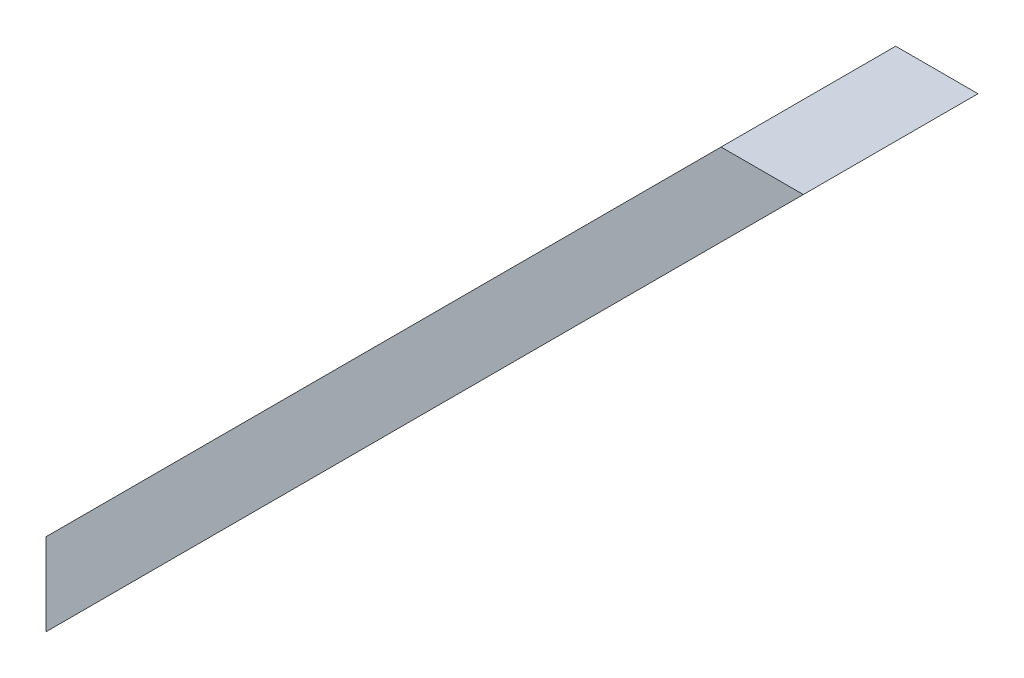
ISO-10303-21;
HEADER;
FILE_DESCRIPTION(('STEP AP214'),'2;1');
FILE_NAME('part.step','',(''),(''),'','','');
FILE_SCHEMA(('AUTOMOTIVE_DESIGN { 1 0 10303 214 1 1 1 1 }'));
ENDSEC;
DATA;
#1=APPLICATION_CONTEXT('core data for automotive mechanical design processes');
#2=APPLICATION_PROTOCOL_DEFINITION('international standard','automotive_design',2000,#1);
#3=PRODUCT_CONTEXT('',#1,'mechanical');
#4=PRODUCT('Part','Part','',(#3));
#5=PRODUCT_RELATED_PRODUCT_CATEGORY('part','',(#4));
#6=PRODUCT_DEFINITION_FORMATION('','',#4);
#7=PRODUCT_DEFINITION_CONTEXT('part definition',#1,'design');
#8=PRODUCT_DEFINITION('design','',#6,#7);
#9=PRODUCT_DEFINITION_SHAPE('','',#8);
#10=(LENGTH_UNIT() NAMED_UNIT(*) SI_UNIT(.MILLI.,.METRE.));
#11=(NAMED_UNIT(*) PLANE_ANGLE_UNIT() SI_UNIT($,.RADIAN.));
#12=(NAMED_UNIT(*) SI_UNIT($,.STERADIAN.) SOLID_ANGLE_UNIT());
#13=UNCERTAINTY_MEASURE_WITH_UNIT(LENGTH_MEASURE(1.E-05),#10,'distance_accuracy_value','');
#14=(GEOMETRIC_REPRESENTATION_CONTEXT(3) GLOBAL_UNCERTAINTY_ASSIGNED_CONTEXT((#13)) GLOBAL_UNIT_ASSIGNED_CONTEXT((#10,
#11,#12)) REPRESENTATION_CONTEXT('',''));
#15=CARTESIAN_POINT('',(0.,0.,0.));
#16=DIRECTION('',(0.,0.,1.));
#17=DIRECTION('',(1.,0.,0.));
#18=AXIS2_PLACEMENT_3D('',#15,#16,#17);
#19=CARTESIAN_POINT('',(0.,-115.965512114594,30.));
#20=DIRECTION('',(1.,0.,0.));
#21=DIRECTION('',(0.,1.,0.));
#22=AXIS2_PLACEMENT_3D('',#19,#20,#21);
#23=PLANE('',#22);
#24=DIRECTION('',(0.,-1.,0.));
#25=VECTOR('',#24,1.);
#26=CARTESIAN_POINT('',(0.,-115.965512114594,0.));
#27=LINE('',#26,#25);
#28=CARTESIAN_POINT('',(0.,-115.965512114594,0.));
#29=VERTEX_POINT('',#28);
#30=CARTESIAN_POINT('',(0.,-130.107647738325,0.));
#31=VERTEX_POINT('',#30);
#32=EDGE_CURVE('E76',#29,#31,#27,.T.);
#33=ORIENTED_EDGE('',*,*,#32,.T.);
#34=DIRECTION('',(0.,0.,-1.));
#35=VECTOR('',#34,1.);
#36=CARTESIAN_POINT('',(0.,-130.107647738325,30.));
#37=LINE('',#36,#35);
#38=CARTESIAN_POINT('',(0.,-130.107647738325,30.));
#39=VERTEX_POINT('',#38);
#40=EDGE_CURVE('E11',#39,#31,#37,.T.);
#41=ORIENTED_EDGE('',*,*,#40,.F.);
#42=DIRECTION('',(0.,-1.,0.));
#43=VECTOR('',#42,1.);
#44=CARTESIAN_POINT('',(0.,-115.965512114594,30.));
#45=LINE('',#44,#43);
#46=CARTESIAN_POINT('',(0.,-115.965512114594,30.));
#47=VERTEX_POINT('',#46);
#48=EDGE_CURVE('E94',#47,#39,#45,.T.);
#49=ORIENTED_EDGE('',*,*,#48,.F.);
#50=DIRECTION('',(0.,0.,-1.));
#51=VECTOR('',#50,1.);
#52=CARTESIAN_POINT('',(0.,-115.965512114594,30.));
#53=LINE('',#52,#51);
#54=EDGE_CURVE('E88',#47,#29,#53,.T.);
#55=ORIENTED_EDGE('',*,*,#54,.T.);
#56=EDGE_LOOP('',(#33,#41,#49,#55));
#57=FACE_BOUND('',#56,.T.);
#58=ADVANCED_FACE('F32',(#57),#23,.F.);
#59=CARTESIAN_POINT('',(0.,-130.107647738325,30.));
#60=DIRECTION('',(-0.707106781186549,0.707106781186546,0.));
#61=DIRECTION('',(-0.707106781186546,-0.707106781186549,0.));
#62=AXIS2_PLACEMENT_3D('',#59,#60,#61);
#63=PLANE('',#62);
#64=DIRECTION('',(0.707106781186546,0.707106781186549,0.));
#65=VECTOR('',#64,1.);
#66=CARTESIAN_POINT('',(0.,-130.107647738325,0.));
#67=LINE('',#66,#65);
#68=CARTESIAN_POINT('',(130.107647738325,0.,0.));
#69=VERTEX_POINT('',#68);
#70=EDGE_CURVE('E72',#31,#69,#67,.T.);
#71=ORIENTED_EDGE('',*,*,#70,.T.);
#72=DIRECTION('',(0.,0.,-1.));
#73=VECTOR('',#72,1.);
#74=CARTESIAN_POINT('',(130.107647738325,0.,30.));
#75=LINE('',#74,#73);
#76=CARTESIAN_POINT('',(130.107647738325,0.,30.));
#77=VERTEX_POINT('',#76);
#78=EDGE_CURVE('E39',#77,#69,#75,.T.);
#79=ORIENTED_EDGE('',*,*,#78,.F.);
#80=DIRECTION('',(0.707106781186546,0.707106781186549,0.));
#81=VECTOR('',#80,1.);
#82=CARTESIAN_POINT('',(0.,-130.107647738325,30.));
#83=LINE('',#82,#81);
#84=EDGE_CURVE('E84',#39,#77,#83,.T.);
#85=ORIENTED_EDGE('',*,*,#84,.F.);
#86=ORIENTED_EDGE('',*,*,#40,.T.);
#87=EDGE_LOOP('',(#71,#79,#85,#86));
#88=FACE_BOUND('',#87,.T.);
#89=ADVANCED_FACE('F83',(#88),#63,.F.);
#90=CARTESIAN_POINT('',(130.107647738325,0.,30.));
#91=DIRECTION('',(0.,-1.,0.));
#92=DIRECTION('',(1.,0.,0.));
#93=AXIS2_PLACEMENT_3D('',#90,#91,#92);
#94=PLANE('',#93);
#95=DIRECTION('',(-1.,0.,0.));
#96=VECTOR('',#95,1.);
#97=CARTESIAN_POINT('',(130.107647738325,0.,0.));
#98=LINE('',#97,#96);
#99=CARTESIAN_POINT('',(115.965512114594,0.,0.));
#100=VERTEX_POINT('',#99);
#101=EDGE_CURVE('E77',#69,#100,#98,.T.);
#102=ORIENTED_EDGE('',*,*,#101,.T.);
#103=DIRECTION('',(0.,0.,-1.));
#104=VECTOR('',#103,1.);
#105=CARTESIAN_POINT('',(115.965512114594,0.,30.));
#106=LINE('',#105,#104);
#107=CARTESIAN_POINT('',(115.965512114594,0.,30.));
#108=VERTEX_POINT('',#107);
#109=EDGE_CURVE('E100',#108,#100,#106,.T.);
#110=ORIENTED_EDGE('',*,*,#109,.F.);
#111=DIRECTION('',(-1.,0.,0.));
#112=VECTOR('',#111,1.);
#113=CARTESIAN_POINT('',(130.107647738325,0.,30.));
#114=LINE('',#113,#112);
#115=EDGE_CURVE('E51',#77,#108,#114,.T.);
#116=ORIENTED_EDGE('',*,*,#115,.F.);
#117=ORIENTED_EDGE('',*,*,#78,.T.);
#118=EDGE_LOOP('',(#102,#110,#116,#117));
#119=FACE_BOUND('',#118,.T.);
#120=ADVANCED_FACE('F103',(#119),#94,.F.);
#121=CARTESIAN_POINT('',(115.965512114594,0.,30.));
#122=DIRECTION('',(0.707106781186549,-0.707106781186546,0.));
#123=DIRECTION('',(0.707106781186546,0.707106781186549,0.));
#124=AXIS2_PLACEMENT_3D('',#121,#122,#123);
#125=PLANE('',#124);
#126=DIRECTION('',(-0.707106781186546,-0.707106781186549,0.));
#127=VECTOR('',#126,1.);
#128=CARTESIAN_POINT('',(115.965512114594,0.,0.));
#129=LINE('',#128,#127);
#130=EDGE_CURVE('E92',#100,#29,#129,.T.);
#131=ORIENTED_EDGE('',*,*,#130,.T.);
#132=ORIENTED_EDGE('',*,*,#54,.F.);
#133=DIRECTION('',(-0.707106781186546,-0.707106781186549,0.));
#134=VECTOR('',#133,1.);
#135=CARTESIAN_POINT('',(115.965512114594,0.,30.));
#136=LINE('',#135,#134);
#137=EDGE_CURVE('E46',#108,#47,#136,.T.);
#138=ORIENTED_EDGE('',*,*,#137,.F.);
#139=ORIENTED_EDGE('',*,*,#109,.T.);
#140=EDGE_LOOP('',(#131,#132,#138,#139));
#141=FACE_BOUND('',#140,.T.);
#142=ADVANCED_FACE('F105',(#141),#125,.F.);
#143=CARTESIAN_POINT('',(2.22044604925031E-13,0.,30.));
#144=DIRECTION('',(0.,0.,-1.));
#145=DIRECTION('',(-1.,0.,0.));
#146=AXIS2_PLACEMENT_3D('',#143,#144,#145);
#147=PLANE('',#146);
#148=ORIENTED_EDGE('',*,*,#48,.T.);
#149=ORIENTED_EDGE('',*,*,#84,.T.);
#150=ORIENTED_EDGE('',*,*,#115,.T.);
#151=ORIENTED_EDGE('',*,*,#137,.T.);
#152=EDGE_LOOP('',(#148,#149,#150,#151));
#153=FACE_BOUND('',#152,.T.);
#154=ADVANCED_FACE('F106',(#153),#147,.F.);
#155=CARTESIAN_POINT('',(2.22044604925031E-13,0.,0.));
#156=DIRECTION('',(0.,0.,-1.));
#157=DIRECTION('',(-1.,0.,0.));
#158=AXIS2_PLACEMENT_3D('',#155,#156,#157);
#159=PLANE('',#158);
#160=ORIENTED_EDGE('',*,*,#32,.F.);
#161=ORIENTED_EDGE('',*,*,#130,.F.);
#162=ORIENTED_EDGE('',*,*,#101,.F.);
#163=ORIENTED_EDGE('',*,*,#70,.F.);
#164=EDGE_LOOP('',(#160,#161,#162,#163));
#165=FACE_BOUND('',#164,.T.);
#166=ADVANCED_FACE('F73',(#165),#159,.T.);
#167=CLOSED_SHELL('',(#58,#89,#120,#142,#154,#166));
#168=MANIFOLD_SOLID_BREP('B2',#167);
#169=ADVANCED_BREP_SHAPE_REPRESENTATION('',(#18,#168),#14);
#170=SHAPE_DEFINITION_REPRESENTATION(#9,#169);
ENDSEC;
END-ISO-10303-21;
